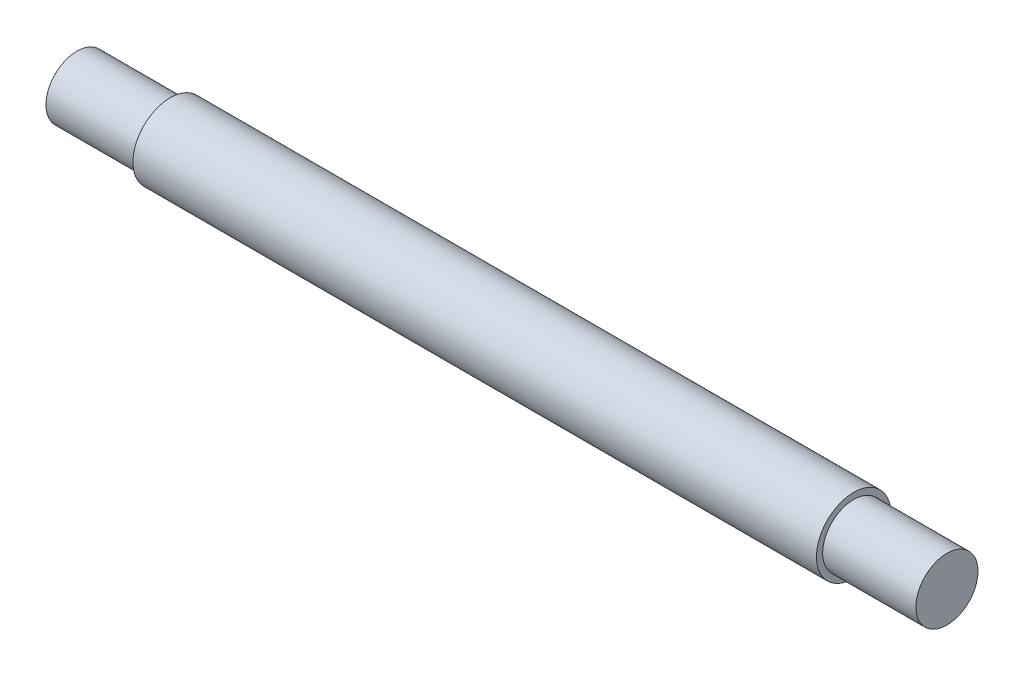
from build123d import *


with BuildPart() as part:
    # Esquisse1 → R_volution1 (revolve)
    with BuildSketch(Plane.XY, mode=Mode.PRIVATE) as r_volution1_sk:
        Polygon((0, 0), (-140, 0), (-140, 5), (-125, 5), (-125, 6), (-15, 6), (-15, 5), (0, 5), align=None)
    revolve(r_volution1_sk.sketch.rotate(Axis((0, 0, 0), (-1, 0, 0)), 90), axis=Axis((0, 0, 0), (-1, 0, 0)))


solid = part.part
